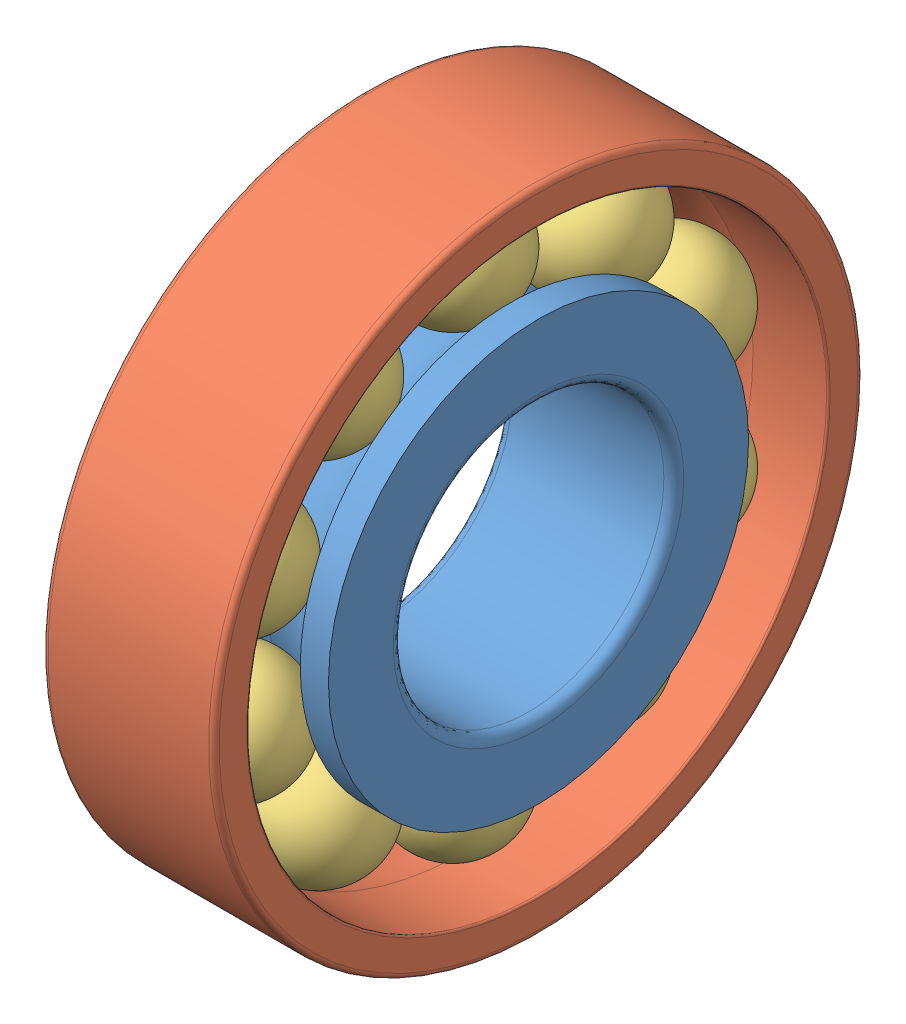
SolidWorks assembly Rodamiento DIN 628-1 7306_BECBM 30x72x19.sldasm, configuration Predeterminado (file format 4400). Lengths in mm.
Overall size (19 72 72).
12 component instances, 3 part files, 0 mates.
Components (placement in the parent):
- 7306_BECBM_PART1-1: 7306_BECBM_PART1.sldprt [Predeterminado] at origin size (19 46.6 46.6)
- 7306_BECBM_PART2-1: 7306_BECBM_PART2.sldprt [Predeterminado] at origin size (19 72 72)
- 7306_BECBM_PART3-1: 7306_BECBM_PART3.sldprt [Predeterminado] at origin size (13.49 13.49 13.49)
- 7306_BECBM_PART3-2: 7306_BECBM_PART3.sldprt [Predeterminado] x (1 0 0) z (0 0.587785 0.809017) size (13.49 13.49 13.49)
- 7306_BECBM_PART3-3: 7306_BECBM_PART3.sldprt [Predeterminado] x (1 0 0) z (0 0.951057 0.309017) size (13.49 13.49 13.49)
- 7306_BECBM_PART3-4: 7306_BECBM_PART3.sldprt [Predeterminado] x (1 0 0) z (0 0.951057 -0.309017) size (13.49 13.49 13.49)
- 7306_BECBM_PART3-5: 7306_BECBM_PART3.sldprt [Predeterminado] x (1 0 0) z (0 0.587785 -0.809017) size (13.49 13.49 13.49)
- 7306_BECBM_PART3-6: 7306_BECBM_PART3.sldprt [Predeterminado] x (1 0 0) z (0 0 -1) size (13.49 13.49 13.49)
- 7306_BECBM_PART3-7: 7306_BECBM_PART3.sldprt [Predeterminado] x (1 0 0) z (0 -0.587785 -0.809017) size (13.49 13.49 13.49)
- 7306_BECBM_PART3-8: 7306_BECBM_PART3.sldprt [Predeterminado] x (1 0 0) z (0 -0.951057 -0.309017) size (13.49 13.49 13.49)
- 7306_BECBM_PART3-9: 7306_BECBM_PART3.sldprt [Predeterminado] x (1 0 0) z (0 -0.951057 0.309017) size (13.49 13.49 13.49)
- 7306_BECBM_PART3-10: 7306_BECBM_PART3.sldprt [Predeterminado] x (1 0 0) z (0 -0.587785 0.809017) size (13.49 13.49 13.49)
